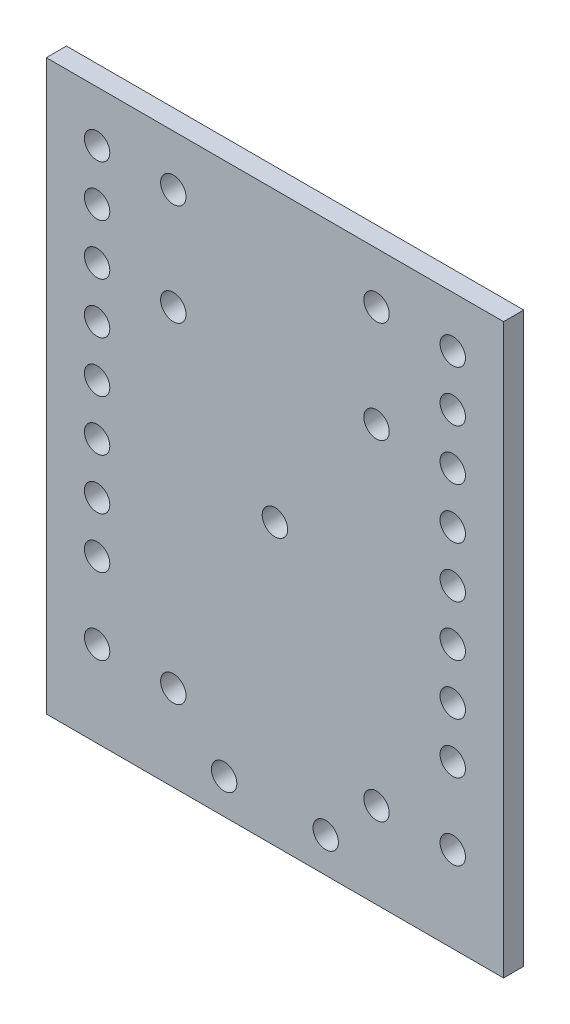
ISO-10303-21;
HEADER;
FILE_DESCRIPTION(('STEP AP214'),'2;1');
FILE_NAME('part.step','',(''),(''),'','','');
FILE_SCHEMA(('AUTOMOTIVE_DESIGN { 1 0 10303 214 1 1 1 1 }'));
ENDSEC;
DATA;
#1=APPLICATION_CONTEXT('core data for automotive mechanical design processes');
#2=APPLICATION_PROTOCOL_DEFINITION('international standard','automotive_design',2000,#1);
#3=PRODUCT_CONTEXT('',#1,'mechanical');
#4=PRODUCT('Part','Part','',(#3));
#5=PRODUCT_RELATED_PRODUCT_CATEGORY('part','',(#4));
#6=PRODUCT_DEFINITION_FORMATION('','',#4);
#7=PRODUCT_DEFINITION_CONTEXT('part definition',#1,'design');
#8=PRODUCT_DEFINITION('design','',#6,#7);
#9=PRODUCT_DEFINITION_SHAPE('','',#8);
#10=(LENGTH_UNIT() NAMED_UNIT(*) SI_UNIT(.MILLI.,.METRE.));
#11=(NAMED_UNIT(*) PLANE_ANGLE_UNIT() SI_UNIT($,.RADIAN.));
#12=(NAMED_UNIT(*) SI_UNIT($,.STERADIAN.) SOLID_ANGLE_UNIT());
#13=UNCERTAINTY_MEASURE_WITH_UNIT(LENGTH_MEASURE(1.E-05),#10,'distance_accuracy_value','');
#14=(GEOMETRIC_REPRESENTATION_CONTEXT(3) GLOBAL_UNCERTAINTY_ASSIGNED_CONTEXT((#13)) GLOBAL_UNIT_ASSIGNED_CONTEXT((#10,
#11,#12)) REPRESENTATION_CONTEXT('',''));
#15=CARTESIAN_POINT('',(0.,0.,0.));
#16=DIRECTION('',(0.,0.,1.));
#17=DIRECTION('',(1.,0.,0.));
#18=AXIS2_PLACEMENT_3D('',#15,#16,#17);
#19=CARTESIAN_POINT('',(36.,-36.,1.5875));
#20=DIRECTION('',(-1.,0.,0.));
#21=DIRECTION('',(0.,0.,1.));
#22=AXIS2_PLACEMENT_3D('',#19,#20,#21);
#23=PLANE('',#22);
#24=DIRECTION('',(0.,1.,0.));
#25=VECTOR('',#24,1.);
#26=CARTESIAN_POINT('',(36.,-36.,-1.5875));
#27=LINE('',#26,#25);
#28=CARTESIAN_POINT('',(36.,-53.5,-1.5875));
#29=VERTEX_POINT('',#28);
#30=CARTESIAN_POINT('',(36.,36.,-1.5875));
#31=VERTEX_POINT('',#30);
#32=EDGE_CURVE('E83',#29,#31,#27,.T.);
#33=ORIENTED_EDGE('',*,*,#32,.T.);
#34=DIRECTION('',(0.,0.,-1.));
#35=VECTOR('',#34,1.);
#36=CARTESIAN_POINT('',(36.,36.,1.5875));
#37=LINE('',#36,#35);
#38=CARTESIAN_POINT('',(36.,36.,1.5875));
#39=VERTEX_POINT('',#38);
#40=EDGE_CURVE('E11',#39,#31,#37,.T.);
#41=ORIENTED_EDGE('',*,*,#40,.F.);
#42=DIRECTION('',(0.,1.,0.));
#43=VECTOR('',#42,1.);
#44=CARTESIAN_POINT('',(36.,-36.,1.5875));
#45=LINE('',#44,#43);
#46=CARTESIAN_POINT('',(36.,-53.5,1.5875));
#47=VERTEX_POINT('',#46);
#48=EDGE_CURVE('E74',#47,#39,#45,.T.);
#49=ORIENTED_EDGE('',*,*,#48,.F.);
#50=DIRECTION('',(0.,0.,-1.));
#51=VECTOR('',#50,1.);
#52=CARTESIAN_POINT('',(36.,-53.5,1.5875));
#53=LINE('',#52,#51);
#54=EDGE_CURVE('E95',#47,#29,#53,.T.);
#55=ORIENTED_EDGE('',*,*,#54,.T.);
#56=EDGE_LOOP('',(#33,#41,#49,#55));
#57=FACE_BOUND('',#56,.T.);
#58=ADVANCED_FACE('F39',(#57),#23,.F.);
#59=CARTESIAN_POINT('',(-36.,36.,1.5875));
#60=DIRECTION('',(0.,-1.,0.));
#61=DIRECTION('',(0.,0.,-1.));
#62=AXIS2_PLACEMENT_3D('',#59,#60,#61);
#63=PLANE('',#62);
#64=DIRECTION('',(-1.,0.,0.));
#65=VECTOR('',#64,1.);
#66=CARTESIAN_POINT('',(-36.,36.,-1.5875));
#67=LINE('',#66,#65);
#68=CARTESIAN_POINT('',(-36.,36.,-1.5875));
#69=VERTEX_POINT('',#68);
#70=EDGE_CURVE('E67',#31,#69,#67,.T.);
#71=ORIENTED_EDGE('',*,*,#70,.T.);
#72=DIRECTION('',(0.,0.,-1.));
#73=VECTOR('',#72,1.);
#74=CARTESIAN_POINT('',(-36.,36.,1.5875));
#75=LINE('',#74,#73);
#76=CARTESIAN_POINT('',(-36.,36.,1.5875));
#77=VERTEX_POINT('',#76);
#78=EDGE_CURVE('E48',#77,#69,#75,.T.);
#79=ORIENTED_EDGE('',*,*,#78,.F.);
#80=DIRECTION('',(-1.,0.,0.));
#81=VECTOR('',#80,1.);
#82=CARTESIAN_POINT('',(-36.,36.,1.5875));
#83=LINE('',#82,#81);
#84=EDGE_CURVE('E56',#39,#77,#83,.T.);
#85=ORIENTED_EDGE('',*,*,#84,.F.);
#86=ORIENTED_EDGE('',*,*,#40,.T.);
#87=EDGE_LOOP('',(#71,#79,#85,#86));
#88=FACE_BOUND('',#87,.T.);
#89=ADVANCED_FACE('F231',(#88),#63,.F.);
#90=CARTESIAN_POINT('',(-36.,-36.,1.5875));
#91=DIRECTION('',(1.,0.,0.));
#92=DIRECTION('',(0.,0.,-1.));
#93=AXIS2_PLACEMENT_3D('',#90,#91,#92);
#94=PLANE('',#93);
#95=DIRECTION('',(0.,-1.,0.));
#96=VECTOR('',#95,1.);
#97=CARTESIAN_POINT('',(-36.,-36.,-1.5875));
#98=LINE('',#97,#96);
#99=CARTESIAN_POINT('',(-36.,-53.5,-1.5875));
#100=VERTEX_POINT('',#99);
#101=EDGE_CURVE('E215',#69,#100,#98,.T.);
#102=ORIENTED_EDGE('',*,*,#101,.T.);
#103=DIRECTION('',(0.,0.,-1.));
#104=VECTOR('',#103,1.);
#105=CARTESIAN_POINT('',(-36.,-53.5,1.5875));
#106=LINE('',#105,#104);
#107=CARTESIAN_POINT('',(-36.,-53.5,1.5875));
#108=VERTEX_POINT('',#107);
#109=EDGE_CURVE('E97',#108,#100,#106,.T.);
#110=ORIENTED_EDGE('',*,*,#109,.F.);
#111=DIRECTION('',(0.,-1.,0.));
#112=VECTOR('',#111,1.);
#113=CARTESIAN_POINT('',(-36.,-36.,1.5875));
#114=LINE('',#113,#112);
#115=EDGE_CURVE('E218',#77,#108,#114,.T.);
#116=ORIENTED_EDGE('',*,*,#115,.F.);
#117=ORIENTED_EDGE('',*,*,#78,.T.);
#118=EDGE_LOOP('',(#102,#110,#116,#117));
#119=FACE_BOUND('',#118,.T.);
#120=ADVANCED_FACE('F229',(#119),#94,.F.);
#121=CARTESIAN_POINT('',(0.,0.,1.5875));
#122=DIRECTION('',(0.,0.,-1.));
#123=DIRECTION('',(-1.,0.,0.));
#124=AXIS2_PLACEMENT_3D('',#121,#122,#123);
#125=PLANE('',#124);
#126=CARTESIAN_POINT('',(7.99999999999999,-48.,1.5875));
#127=DIRECTION('',(0.,0.,-1.));
#128=DIRECTION('',(-1.,0.,0.));
#129=AXIS2_PLACEMENT_3D('',#126,#127,#128);
#130=CIRCLE('',#129,2.);
#131=CARTESIAN_POINT('',(5.99999999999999,-48.,1.5875));
#132=VERTEX_POINT('',#131);
#133=EDGE_CURVE('E713',#132,#132,#130,.T.);
#134=ORIENTED_EDGE('',*,*,#133,.T.);
#135=EDGE_LOOP('',(#134));
#136=FACE_BOUND('',#135,.T.);
#137=CARTESIAN_POINT('',(16.,-40.,1.5875));
#138=DIRECTION('',(0.,0.,-1.));
#139=DIRECTION('',(-1.,0.,0.));
#140=AXIS2_PLACEMENT_3D('',#137,#138,#139);
#141=CIRCLE('',#140,2.);
#142=CARTESIAN_POINT('',(14.,-40.,1.5875));
#143=VERTEX_POINT('',#142);
#144=EDGE_CURVE('E723',#143,#143,#141,.T.);
#145=ORIENTED_EDGE('',*,*,#144,.T.);
#146=EDGE_LOOP('',(#145));
#147=FACE_BOUND('',#146,.T.);
#148=CARTESIAN_POINT('',(16.,28.,1.5875));
#149=DIRECTION('',(0.,0.,-1.));
#150=DIRECTION('',(-1.,0.,0.));
#151=AXIS2_PLACEMENT_3D('',#148,#149,#150);
#152=CIRCLE('',#151,2.);
#153=CARTESIAN_POINT('',(14.,28.,1.5875));
#154=VERTEX_POINT('',#153);
#155=EDGE_CURVE('E737',#154,#154,#152,.T.);
#156=ORIENTED_EDGE('',*,*,#155,.T.);
#157=EDGE_LOOP('',(#156));
#158=FACE_BOUND('',#157,.T.);
#159=CARTESIAN_POINT('',(28.,20.,1.5875));
#160=DIRECTION('',(0.,0.,-1.));
#161=DIRECTION('',(-1.,0.,0.));
#162=AXIS2_PLACEMENT_3D('',#159,#160,#161);
#163=CIRCLE('',#162,2.);
#164=CARTESIAN_POINT('',(26.,20.,1.5875));
#165=VERTEX_POINT('',#164);
#166=EDGE_CURVE('E747',#165,#165,#163,.T.);
#167=ORIENTED_EDGE('',*,*,#166,.T.);
#168=EDGE_LOOP('',(#167));
#169=FACE_BOUND('',#168,.T.);
#170=CARTESIAN_POINT('',(28.,12.,1.5875));
#171=DIRECTION('',(0.,0.,-1.));
#172=DIRECTION('',(-1.,0.,0.));
#173=AXIS2_PLACEMENT_3D('',#170,#171,#172);
#174=CIRCLE('',#173,2.);
#175=CARTESIAN_POINT('',(26.,12.,1.5875));
#176=VERTEX_POINT('',#175);
#177=EDGE_CURVE('E755',#176,#176,#174,.T.);
#178=ORIENTED_EDGE('',*,*,#177,.T.);
#179=EDGE_LOOP('',(#178));
#180=FACE_BOUND('',#179,.T.);
#181=CARTESIAN_POINT('',(28.,4.,1.5875));
#182=DIRECTION('',(0.,0.,-1.));
#183=DIRECTION('',(-1.,0.,0.));
#184=AXIS2_PLACEMENT_3D('',#181,#182,#183);
#185=CIRCLE('',#184,2.);
#186=CARTESIAN_POINT('',(26.,4.,1.5875));
#187=VERTEX_POINT('',#186);
#188=EDGE_CURVE('E763',#187,#187,#185,.T.);
#189=ORIENTED_EDGE('',*,*,#188,.T.);
#190=EDGE_LOOP('',(#189));
#191=FACE_BOUND('',#190,.T.);
#192=CARTESIAN_POINT('',(28.,-4.,1.5875));
#193=DIRECTION('',(0.,0.,-1.));
#194=DIRECTION('',(-1.,0.,0.));
#195=AXIS2_PLACEMENT_3D('',#192,#193,#194);
#196=CIRCLE('',#195,2.);
#197=CARTESIAN_POINT('',(26.,-4.,1.5875));
#198=VERTEX_POINT('',#197);
#199=EDGE_CURVE('E771',#198,#198,#196,.T.);
#200=ORIENTED_EDGE('',*,*,#199,.T.);
#201=EDGE_LOOP('',(#200));
#202=FACE_BOUND('',#201,.T.);
#203=CARTESIAN_POINT('',(28.,-12.,1.5875));
#204=DIRECTION('',(0.,0.,-1.));
#205=DIRECTION('',(-1.,0.,0.));
#206=AXIS2_PLACEMENT_3D('',#203,#204,#205);
#207=CIRCLE('',#206,2.);
#208=CARTESIAN_POINT('',(26.,-12.,1.5875));
#209=VERTEX_POINT('',#208);
#210=EDGE_CURVE('E779',#209,#209,#207,.T.);
#211=ORIENTED_EDGE('',*,*,#210,.T.);
#212=EDGE_LOOP('',(#211));
#213=FACE_BOUND('',#212,.T.);
#214=CARTESIAN_POINT('',(28.,-20.,1.5875));
#215=DIRECTION('',(0.,0.,-1.));
#216=DIRECTION('',(-1.,0.,0.));
#217=AXIS2_PLACEMENT_3D('',#214,#215,#216);
#218=CIRCLE('',#217,2.);
#219=CARTESIAN_POINT('',(26.,-20.,1.5875));
#220=VERTEX_POINT('',#219);
#221=EDGE_CURVE('E787',#220,#220,#218,.T.);
#222=ORIENTED_EDGE('',*,*,#221,.T.);
#223=EDGE_LOOP('',(#222));
#224=FACE_BOUND('',#223,.T.);
#225=CARTESIAN_POINT('',(28.,-28.,1.5875));
#226=DIRECTION('',(0.,0.,-1.));
#227=DIRECTION('',(-1.,0.,0.));
#228=AXIS2_PLACEMENT_3D('',#225,#226,#227);
#229=CIRCLE('',#228,2.);
#230=CARTESIAN_POINT('',(26.,-28.,1.5875));
#231=VERTEX_POINT('',#230);
#232=EDGE_CURVE('E736',#231,#231,#229,.T.);
#233=ORIENTED_EDGE('',*,*,#232,.T.);
#234=EDGE_LOOP('',(#233));
#235=FACE_BOUND('',#234,.T.);
#236=CARTESIAN_POINT('',(16.,12.,1.5875));
#237=DIRECTION('',(0.,0.,-1.));
#238=DIRECTION('',(-1.,0.,0.));
#239=AXIS2_PLACEMENT_3D('',#236,#237,#238);
#240=CIRCLE('',#239,2.);
#241=CARTESIAN_POINT('',(14.,12.,1.5875));
#242=VERTEX_POINT('',#241);
#243=EDGE_CURVE('E720',#242,#242,#240,.T.);
#244=ORIENTED_EDGE('',*,*,#243,.T.);
#245=EDGE_LOOP('',(#244));
#246=FACE_BOUND('',#245,.T.);
#247=CARTESIAN_POINT('',(28.,28.,1.5875));
#248=DIRECTION('',(0.,0.,-1.));
#249=DIRECTION('',(-1.,0.,0.));
#250=AXIS2_PLACEMENT_3D('',#247,#248,#249);
#251=CIRCLE('',#250,2.);
#252=CARTESIAN_POINT('',(26.,28.,1.5875));
#253=VERTEX_POINT('',#252);
#254=EDGE_CURVE('E746',#253,#253,#251,.T.);
#255=ORIENTED_EDGE('',*,*,#254,.T.);
#256=EDGE_LOOP('',(#255));
#257=FACE_BOUND('',#256,.T.);
#258=CARTESIAN_POINT('',(-7.99999999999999,-48.,1.5875));
#259=DIRECTION('',(0.,0.,1.));
#260=DIRECTION('',(1.,0.,0.));
#261=AXIS2_PLACEMENT_3D('',#258,#259,#260);
#262=CIRCLE('',#261,2.);
#263=CARTESIAN_POINT('',(-5.99999999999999,-48.,1.5875));
#264=VERTEX_POINT('',#263);
#265=EDGE_CURVE('E812',#264,#264,#262,.T.);
#266=ORIENTED_EDGE('',*,*,#265,.F.);
#267=EDGE_LOOP('',(#266));
#268=FACE_BOUND('',#267,.T.);
#269=CARTESIAN_POINT('',(-16.,-40.,1.5875));
#270=DIRECTION('',(0.,0.,1.));
#271=DIRECTION('',(1.,0.,0.));
#272=AXIS2_PLACEMENT_3D('',#269,#270,#271);
#273=CIRCLE('',#272,2.);
#274=CARTESIAN_POINT('',(-14.,-40.,1.5875));
#275=VERTEX_POINT('',#274);
#276=EDGE_CURVE('E816',#275,#275,#273,.T.);
#277=ORIENTED_EDGE('',*,*,#276,.F.);
#278=EDGE_LOOP('',(#277));
#279=FACE_BOUND('',#278,.T.);
#280=CARTESIAN_POINT('',(-28.,-40.,1.5875));
#281=DIRECTION('',(0.,0.,1.));
#282=DIRECTION('',(1.,0.,0.));
#283=AXIS2_PLACEMENT_3D('',#280,#281,#282);
#284=CIRCLE('',#283,2.);
#285=CARTESIAN_POINT('',(-26.,-40.,1.5875));
#286=VERTEX_POINT('',#285);
#287=EDGE_CURVE('E111',#286,#286,#284,.T.);
#288=ORIENTED_EDGE('',*,*,#287,.F.);
#289=EDGE_LOOP('',(#288));
#290=FACE_BOUND('',#289,.T.);
#291=CARTESIAN_POINT('',(28.,-40.,1.5875));
#292=DIRECTION('',(0.,0.,1.));
#293=DIRECTION('',(-1.,0.,0.));
#294=AXIS2_PLACEMENT_3D('',#291,#292,#293);
#295=CIRCLE('',#294,2.);
#296=CARTESIAN_POINT('',(26.,-40.,1.5875));
#297=VERTEX_POINT('',#296);
#298=EDGE_CURVE('E116',#297,#297,#295,.T.);
#299=ORIENTED_EDGE('',*,*,#298,.F.);
#300=EDGE_LOOP('',(#299));
#301=FACE_BOUND('',#300,.T.);
#302=CARTESIAN_POINT('',(0.,-9.34223898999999,1.5875));
#303=DIRECTION('',(0.,0.,1.));
#304=DIRECTION('',(1.,0.,0.));
#305=AXIS2_PLACEMENT_3D('',#302,#303,#304);
#306=CIRCLE('',#305,2.);
#307=CARTESIAN_POINT('',(2.,-9.34223898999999,1.5875));
#308=VERTEX_POINT('',#307);
#309=EDGE_CURVE('E120',#308,#308,#306,.T.);
#310=ORIENTED_EDGE('',*,*,#309,.F.);
#311=EDGE_LOOP('',(#310));
#312=FACE_BOUND('',#311,.T.);
#313=CARTESIAN_POINT('',(-16.,28.,1.5875));
#314=DIRECTION('',(0.,0.,1.));
#315=DIRECTION('',(1.,0.,0.));
#316=AXIS2_PLACEMENT_3D('',#313,#314,#315);
#317=CIRCLE('',#316,2.);
#318=CARTESIAN_POINT('',(-14.,28.,1.5875));
#319=VERTEX_POINT('',#318);
#320=EDGE_CURVE('E147',#319,#319,#317,.T.);
#321=ORIENTED_EDGE('',*,*,#320,.F.);
#322=EDGE_LOOP('',(#321));
#323=FACE_BOUND('',#322,.T.);
#324=CARTESIAN_POINT('',(-28.,20.,1.5875));
#325=DIRECTION('',(0.,0.,1.));
#326=DIRECTION('',(1.,0.,0.));
#327=AXIS2_PLACEMENT_3D('',#324,#325,#326);
#328=CIRCLE('',#327,2.);
#329=CARTESIAN_POINT('',(-26.,20.,1.5875));
#330=VERTEX_POINT('',#329);
#331=EDGE_CURVE('E148',#330,#330,#328,.T.);
#332=ORIENTED_EDGE('',*,*,#331,.F.);
#333=EDGE_LOOP('',(#332));
#334=FACE_BOUND('',#333,.T.);
#335=CARTESIAN_POINT('',(-28.,12.,1.5875));
#336=DIRECTION('',(0.,0.,1.));
#337=DIRECTION('',(1.,0.,0.));
#338=AXIS2_PLACEMENT_3D('',#335,#336,#337);
#339=CIRCLE('',#338,2.);
#340=CARTESIAN_POINT('',(-26.,12.,1.5875));
#341=VERTEX_POINT('',#340);
#342=EDGE_CURVE('E157',#341,#341,#339,.T.);
#343=ORIENTED_EDGE('',*,*,#342,.F.);
#344=EDGE_LOOP('',(#343));
#345=FACE_BOUND('',#344,.T.);
#346=CARTESIAN_POINT('',(-28.,4.,1.5875));
#347=DIRECTION('',(0.,0.,1.));
#348=DIRECTION('',(1.,0.,0.));
#349=AXIS2_PLACEMENT_3D('',#346,#347,#348);
#350=CIRCLE('',#349,2.);
#351=CARTESIAN_POINT('',(-26.,4.,1.5875));
#352=VERTEX_POINT('',#351);
#353=EDGE_CURVE('E165',#352,#352,#350,.T.);
#354=ORIENTED_EDGE('',*,*,#353,.F.);
#355=EDGE_LOOP('',(#354));
#356=FACE_BOUND('',#355,.T.);
#357=CARTESIAN_POINT('',(-28.,-4.,1.5875));
#358=DIRECTION('',(0.,0.,1.));
#359=DIRECTION('',(1.,0.,0.));
#360=AXIS2_PLACEMENT_3D('',#357,#358,#359);
#361=CIRCLE('',#360,2.);
#362=CARTESIAN_POINT('',(-26.,-4.,1.5875));
#363=VERTEX_POINT('',#362);
#364=EDGE_CURVE('E173',#363,#363,#361,.T.);
#365=ORIENTED_EDGE('',*,*,#364,.F.);
#366=EDGE_LOOP('',(#365));
#367=FACE_BOUND('',#366,.T.);
#368=CARTESIAN_POINT('',(-28.,-12.,1.5875));
#369=DIRECTION('',(0.,0.,1.));
#370=DIRECTION('',(1.,0.,0.));
#371=AXIS2_PLACEMENT_3D('',#368,#369,#370);
#372=CIRCLE('',#371,2.);
#373=CARTESIAN_POINT('',(-26.,-12.,1.5875));
#374=VERTEX_POINT('',#373);
#375=EDGE_CURVE('E181',#374,#374,#372,.T.);
#376=ORIENTED_EDGE('',*,*,#375,.F.);
#377=EDGE_LOOP('',(#376));
#378=FACE_BOUND('',#377,.T.);
#379=CARTESIAN_POINT('',(-28.,-20.,1.5875));
#380=DIRECTION('',(0.,0.,1.));
#381=DIRECTION('',(1.,0.,0.));
#382=AXIS2_PLACEMENT_3D('',#379,#380,#381);
#383=CIRCLE('',#382,2.);
#384=CARTESIAN_POINT('',(-26.,-20.,1.5875));
#385=VERTEX_POINT('',#384);
#386=EDGE_CURVE('E189',#385,#385,#383,.T.);
#387=ORIENTED_EDGE('',*,*,#386,.F.);
#388=EDGE_LOOP('',(#387));
#389=FACE_BOUND('',#388,.T.);
#390=CARTESIAN_POINT('',(-28.,-28.,1.5875));
#391=DIRECTION('',(0.,0.,1.));
#392=DIRECTION('',(1.,0.,0.));
#393=AXIS2_PLACEMENT_3D('',#390,#391,#392);
#394=CIRCLE('',#393,2.);
#395=CARTESIAN_POINT('',(-26.,-28.,1.5875));
#396=VERTEX_POINT('',#395);
#397=EDGE_CURVE('E197',#396,#396,#394,.T.);
#398=ORIENTED_EDGE('',*,*,#397,.F.);
#399=EDGE_LOOP('',(#398));
#400=FACE_BOUND('',#399,.T.);
#401=CARTESIAN_POINT('',(-16.,12.,1.5875));
#402=DIRECTION('',(0.,0.,1.));
#403=DIRECTION('',(1.,0.,0.));
#404=AXIS2_PLACEMENT_3D('',#401,#402,#403);
#405=CIRCLE('',#404,2.);
#406=CARTESIAN_POINT('',(-14.,12.,1.5875));
#407=VERTEX_POINT('',#406);
#408=EDGE_CURVE('E138',#407,#407,#405,.T.);
#409=ORIENTED_EDGE('',*,*,#408,.F.);
#410=EDGE_LOOP('',(#409));
#411=FACE_BOUND('',#410,.T.);
#412=CARTESIAN_POINT('',(-28.,28.,1.5875));
#413=DIRECTION('',(0.,0.,1.));
#414=DIRECTION('',(1.,0.,0.));
#415=AXIS2_PLACEMENT_3D('',#412,#413,#414);
#416=CIRCLE('',#415,2.);
#417=CARTESIAN_POINT('',(-26.,28.,1.5875));
#418=VERTEX_POINT('',#417);
#419=EDGE_CURVE('E152',#418,#418,#416,.T.);
#420=ORIENTED_EDGE('',*,*,#419,.F.);
#421=EDGE_LOOP('',(#420));
#422=FACE_BOUND('',#421,.T.);
#423=ORIENTED_EDGE('',*,*,#48,.T.);
#424=ORIENTED_EDGE('',*,*,#84,.T.);
#425=ORIENTED_EDGE('',*,*,#115,.T.);
#426=DIRECTION('',(1.,0.,0.));
#427=VECTOR('',#426,1.);
#428=CARTESIAN_POINT('',(-36.,-53.5,1.5875));
#429=LINE('',#428,#427);
#430=EDGE_CURVE('E99',#108,#47,#429,.T.);
#431=ORIENTED_EDGE('',*,*,#430,.T.);
#432=EDGE_LOOP('',(#423,#424,#425,#431));
#433=FACE_BOUND('',#432,.T.);
#434=ADVANCED_FACE('F232',(#136,#147,#158,#169,#180,#191,#202,#213,#224,#235,#246,#257,#268,
#279,#290,#301,#312,#323,#334,#345,#356,#367,#378,#389,#400,#411,#422,#433),#125,.F.);
#435=CARTESIAN_POINT('',(0.,0.,-1.5875));
#436=DIRECTION('',(0.,0.,-1.));
#437=DIRECTION('',(-1.,0.,0.));
#438=AXIS2_PLACEMENT_3D('',#435,#436,#437);
#439=PLANE('',#438);
#440=CARTESIAN_POINT('',(7.99999999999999,-48.,-1.5875));
#441=DIRECTION('',(0.,0.,-1.));
#442=DIRECTION('',(-1.,0.,0.));
#443=AXIS2_PLACEMENT_3D('',#440,#441,#442);
#444=CIRCLE('',#443,2.);
#445=CARTESIAN_POINT('',(5.99999999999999,-48.,-1.5875));
#446=VERTEX_POINT('',#445);
#447=EDGE_CURVE('E711',#446,#446,#444,.T.);
#448=ORIENTED_EDGE('',*,*,#447,.F.);
#449=EDGE_LOOP('',(#448));
#450=FACE_BOUND('',#449,.T.);
#451=CARTESIAN_POINT('',(16.,-40.,-1.5875));
#452=DIRECTION('',(0.,0.,-1.));
#453=DIRECTION('',(-1.,0.,0.));
#454=AXIS2_PLACEMENT_3D('',#451,#452,#453);
#455=CIRCLE('',#454,2.);
#456=CARTESIAN_POINT('',(14.,-40.,-1.5875));
#457=VERTEX_POINT('',#456);
#458=EDGE_CURVE('E715',#457,#457,#455,.T.);
#459=ORIENTED_EDGE('',*,*,#458,.F.);
#460=EDGE_LOOP('',(#459));
#461=FACE_BOUND('',#460,.T.);
#462=CARTESIAN_POINT('',(16.,28.,-1.5875));
#463=DIRECTION('',(0.,0.,-1.));
#464=DIRECTION('',(-1.,0.,0.));
#465=AXIS2_PLACEMENT_3D('',#462,#463,#464);
#466=CIRCLE('',#465,2.);
#467=CARTESIAN_POINT('',(14.,28.,-1.5875));
#468=VERTEX_POINT('',#467);
#469=EDGE_CURVE('E741',#468,#468,#466,.T.);
#470=ORIENTED_EDGE('',*,*,#469,.F.);
#471=EDGE_LOOP('',(#470));
#472=FACE_BOUND('',#471,.T.);
#473=CARTESIAN_POINT('',(28.,20.,-1.5875));
#474=DIRECTION('',(0.,0.,-1.));
#475=DIRECTION('',(-1.,0.,0.));
#476=AXIS2_PLACEMENT_3D('',#473,#474,#475);
#477=CIRCLE('',#476,2.);
#478=CARTESIAN_POINT('',(26.,20.,-1.5875));
#479=VERTEX_POINT('',#478);
#480=EDGE_CURVE('E742',#479,#479,#477,.T.);
#481=ORIENTED_EDGE('',*,*,#480,.F.);
#482=EDGE_LOOP('',(#481));
#483=FACE_BOUND('',#482,.T.);
#484=CARTESIAN_POINT('',(28.,12.,-1.5875));
#485=DIRECTION('',(0.,0.,-1.));
#486=DIRECTION('',(-1.,0.,0.));
#487=AXIS2_PLACEMENT_3D('',#484,#485,#486);
#488=CIRCLE('',#487,2.);
#489=CARTESIAN_POINT('',(26.,12.,-1.5875));
#490=VERTEX_POINT('',#489);
#491=EDGE_CURVE('E751',#490,#490,#488,.T.);
#492=ORIENTED_EDGE('',*,*,#491,.F.);
#493=EDGE_LOOP('',(#492));
#494=FACE_BOUND('',#493,.T.);
#495=CARTESIAN_POINT('',(28.,4.,-1.5875));
#496=DIRECTION('',(0.,0.,-1.));
#497=DIRECTION('',(-1.,0.,0.));
#498=AXIS2_PLACEMENT_3D('',#495,#496,#497);
#499=CIRCLE('',#498,2.);
#500=CARTESIAN_POINT('',(26.,4.,-1.5875));
#501=VERTEX_POINT('',#500);
#502=EDGE_CURVE('E759',#501,#501,#499,.T.);
#503=ORIENTED_EDGE('',*,*,#502,.F.);
#504=EDGE_LOOP('',(#503));
#505=FACE_BOUND('',#504,.T.);
#506=CARTESIAN_POINT('',(28.,-4.,-1.5875));
#507=DIRECTION('',(0.,0.,-1.));
#508=DIRECTION('',(-1.,0.,0.));
#509=AXIS2_PLACEMENT_3D('',#506,#507,#508);
#510=CIRCLE('',#509,2.);
#511=CARTESIAN_POINT('',(26.,-4.,-1.5875));
#512=VERTEX_POINT('',#511);
#513=EDGE_CURVE('E767',#512,#512,#510,.T.);
#514=ORIENTED_EDGE('',*,*,#513,.F.);
#515=EDGE_LOOP('',(#514));
#516=FACE_BOUND('',#515,.T.);
#517=CARTESIAN_POINT('',(28.,-12.,-1.5875));
#518=DIRECTION('',(0.,0.,-1.));
#519=DIRECTION('',(-1.,0.,0.));
#520=AXIS2_PLACEMENT_3D('',#517,#518,#519);
#521=CIRCLE('',#520,2.);
#522=CARTESIAN_POINT('',(26.,-12.,-1.5875));
#523=VERTEX_POINT('',#522);
#524=EDGE_CURVE('E775',#523,#523,#521,.T.);
#525=ORIENTED_EDGE('',*,*,#524,.F.);
#526=EDGE_LOOP('',(#525));
#527=FACE_BOUND('',#526,.T.);
#528=CARTESIAN_POINT('',(28.,-20.,-1.5875));
#529=DIRECTION('',(0.,0.,-1.));
#530=DIRECTION('',(-1.,0.,0.));
#531=AXIS2_PLACEMENT_3D('',#528,#529,#530);
#532=CIRCLE('',#531,2.);
#533=CARTESIAN_POINT('',(26.,-20.,-1.5875));
#534=VERTEX_POINT('',#533);
#535=EDGE_CURVE('E783',#534,#534,#532,.T.);
#536=ORIENTED_EDGE('',*,*,#535,.F.);
#537=EDGE_LOOP('',(#536));
#538=FACE_BOUND('',#537,.T.);
#539=CARTESIAN_POINT('',(28.,-28.,-1.5875));
#540=DIRECTION('',(0.,0.,-1.));
#541=DIRECTION('',(-1.,0.,0.));
#542=AXIS2_PLACEMENT_3D('',#539,#540,#541);
#543=CIRCLE('',#542,2.);
#544=CARTESIAN_POINT('',(26.,-28.,-1.5875));
#545=VERTEX_POINT('',#544);
#546=EDGE_CURVE('E791',#545,#545,#543,.T.);
#547=ORIENTED_EDGE('',*,*,#546,.F.);
#548=EDGE_LOOP('',(#547));
#549=FACE_BOUND('',#548,.T.);
#550=CARTESIAN_POINT('',(16.,12.,-1.5875));
#551=DIRECTION('',(0.,0.,-1.));
#552=DIRECTION('',(-1.,0.,0.));
#553=AXIS2_PLACEMENT_3D('',#550,#551,#552);
#554=CIRCLE('',#553,2.);
#555=CARTESIAN_POINT('',(14.,12.,-1.5875));
#556=VERTEX_POINT('',#555);
#557=EDGE_CURVE('E732',#556,#556,#554,.T.);
#558=ORIENTED_EDGE('',*,*,#557,.F.);
#559=EDGE_LOOP('',(#558));
#560=FACE_BOUND('',#559,.T.);
#561=CARTESIAN_POINT('',(28.,28.,-1.5875));
#562=DIRECTION('',(0.,0.,-1.));
#563=DIRECTION('',(-1.,0.,0.));
#564=AXIS2_PLACEMENT_3D('',#561,#562,#563);
#565=CIRCLE('',#564,2.);
#566=CARTESIAN_POINT('',(26.,28.,-1.5875));
#567=VERTEX_POINT('',#566);
#568=EDGE_CURVE('E804',#567,#567,#565,.T.);
#569=ORIENTED_EDGE('',*,*,#568,.F.);
#570=EDGE_LOOP('',(#569));
#571=FACE_BOUND('',#570,.T.);
#572=CARTESIAN_POINT('',(-7.99999999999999,-48.,-1.5875));
#573=DIRECTION('',(0.,0.,1.));
#574=DIRECTION('',(1.,0.,0.));
#575=AXIS2_PLACEMENT_3D('',#572,#573,#574);
#576=CIRCLE('',#575,2.);
#577=CARTESIAN_POINT('',(-5.99999999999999,-48.,-1.5875));
#578=VERTEX_POINT('',#577);
#579=EDGE_CURVE('E100',#578,#578,#576,.T.);
#580=ORIENTED_EDGE('',*,*,#579,.T.);
#581=EDGE_LOOP('',(#580));
#582=FACE_BOUND('',#581,.T.);
#583=CARTESIAN_POINT('',(-16.,-40.,-1.5875));
#584=DIRECTION('',(0.,0.,1.));
#585=DIRECTION('',(1.,0.,0.));
#586=AXIS2_PLACEMENT_3D('',#583,#584,#585);
#587=CIRCLE('',#586,2.);
#588=CARTESIAN_POINT('',(-14.,-40.,-1.5875));
#589=VERTEX_POINT('',#588);
#590=EDGE_CURVE('E808',#589,#589,#587,.T.);
#591=ORIENTED_EDGE('',*,*,#590,.T.);
#592=EDGE_LOOP('',(#591));
#593=FACE_BOUND('',#592,.T.);
#594=CARTESIAN_POINT('',(-28.,-40.,-1.5875));
#595=DIRECTION('',(0.,0.,1.));
#596=DIRECTION('',(1.,0.,0.));
#597=AXIS2_PLACEMENT_3D('',#594,#595,#596);
#598=CIRCLE('',#597,2.);
#599=CARTESIAN_POINT('',(-26.,-40.,-1.5875));
#600=VERTEX_POINT('',#599);
#601=EDGE_CURVE('E115',#600,#600,#598,.T.);
#602=ORIENTED_EDGE('',*,*,#601,.T.);
#603=EDGE_LOOP('',(#602));
#604=FACE_BOUND('',#603,.T.);
#605=CARTESIAN_POINT('',(28.,-40.,-1.5875));
#606=DIRECTION('',(0.,0.,1.));
#607=DIRECTION('',(-1.,0.,0.));
#608=AXIS2_PLACEMENT_3D('',#605,#606,#607);
#609=CIRCLE('',#608,2.);
#610=CARTESIAN_POINT('',(26.,-40.,-1.5875));
#611=VERTEX_POINT('',#610);
#612=EDGE_CURVE('E107',#611,#611,#609,.T.);
#613=ORIENTED_EDGE('',*,*,#612,.T.);
#614=EDGE_LOOP('',(#613));
#615=FACE_BOUND('',#614,.T.);
#616=CARTESIAN_POINT('',(0.,-9.34223898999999,-1.5875));
#617=DIRECTION('',(0.,0.,1.));
#618=DIRECTION('',(1.,0.,0.));
#619=AXIS2_PLACEMENT_3D('',#616,#617,#618);
#620=CIRCLE('',#619,2.);
#621=CARTESIAN_POINT('',(2.,-9.34223898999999,-1.5875));
#622=VERTEX_POINT('',#621);
#623=EDGE_CURVE('E130',#622,#622,#620,.T.);
#624=ORIENTED_EDGE('',*,*,#623,.T.);
#625=EDGE_LOOP('',(#624));
#626=FACE_BOUND('',#625,.T.);
#627=CARTESIAN_POINT('',(-16.,28.,-1.5875));
#628=DIRECTION('',(0.,0.,1.));
#629=DIRECTION('',(1.,0.,0.));
#630=AXIS2_PLACEMENT_3D('',#627,#628,#629);
#631=CIRCLE('',#630,2.);
#632=CARTESIAN_POINT('',(-14.,28.,-1.5875));
#633=VERTEX_POINT('',#632);
#634=EDGE_CURVE('E143',#633,#633,#631,.T.);
#635=ORIENTED_EDGE('',*,*,#634,.T.);
#636=EDGE_LOOP('',(#635));
#637=FACE_BOUND('',#636,.T.);
#638=CARTESIAN_POINT('',(-28.,20.,-1.5875));
#639=DIRECTION('',(0.,0.,1.));
#640=DIRECTION('',(1.,0.,0.));
#641=AXIS2_PLACEMENT_3D('',#638,#639,#640);
#642=CIRCLE('',#641,2.);
#643=CARTESIAN_POINT('',(-26.,20.,-1.5875));
#644=VERTEX_POINT('',#643);
#645=EDGE_CURVE('E153',#644,#644,#642,.T.);
#646=ORIENTED_EDGE('',*,*,#645,.T.);
#647=EDGE_LOOP('',(#646));
#648=FACE_BOUND('',#647,.T.);
#649=CARTESIAN_POINT('',(-28.,12.,-1.5875));
#650=DIRECTION('',(0.,0.,1.));
#651=DIRECTION('',(1.,0.,0.));
#652=AXIS2_PLACEMENT_3D('',#649,#650,#651);
#653=CIRCLE('',#652,2.);
#654=CARTESIAN_POINT('',(-26.,12.,-1.5875));
#655=VERTEX_POINT('',#654);
#656=EDGE_CURVE('E161',#655,#655,#653,.T.);
#657=ORIENTED_EDGE('',*,*,#656,.T.);
#658=EDGE_LOOP('',(#657));
#659=FACE_BOUND('',#658,.T.);
#660=CARTESIAN_POINT('',(-28.,4.,-1.5875));
#661=DIRECTION('',(0.,0.,1.));
#662=DIRECTION('',(1.,0.,0.));
#663=AXIS2_PLACEMENT_3D('',#660,#661,#662);
#664=CIRCLE('',#663,2.);
#665=CARTESIAN_POINT('',(-26.,4.,-1.5875));
#666=VERTEX_POINT('',#665);
#667=EDGE_CURVE('E169',#666,#666,#664,.T.);
#668=ORIENTED_EDGE('',*,*,#667,.T.);
#669=EDGE_LOOP('',(#668));
#670=FACE_BOUND('',#669,.T.);
#671=CARTESIAN_POINT('',(-28.,-4.,-1.5875));
#672=DIRECTION('',(0.,0.,1.));
#673=DIRECTION('',(1.,0.,0.));
#674=AXIS2_PLACEMENT_3D('',#671,#672,#673);
#675=CIRCLE('',#674,2.);
#676=CARTESIAN_POINT('',(-26.,-4.,-1.5875));
#677=VERTEX_POINT('',#676);
#678=EDGE_CURVE('E177',#677,#677,#675,.T.);
#679=ORIENTED_EDGE('',*,*,#678,.T.);
#680=EDGE_LOOP('',(#679));
#681=FACE_BOUND('',#680,.T.);
#682=CARTESIAN_POINT('',(-28.,-12.,-1.5875));
#683=DIRECTION('',(0.,0.,1.));
#684=DIRECTION('',(1.,0.,0.));
#685=AXIS2_PLACEMENT_3D('',#682,#683,#684);
#686=CIRCLE('',#685,2.);
#687=CARTESIAN_POINT('',(-26.,-12.,-1.5875));
#688=VERTEX_POINT('',#687);
#689=EDGE_CURVE('E185',#688,#688,#686,.T.);
#690=ORIENTED_EDGE('',*,*,#689,.T.);
#691=EDGE_LOOP('',(#690));
#692=FACE_BOUND('',#691,.T.);
#693=CARTESIAN_POINT('',(-28.,-20.,-1.5875));
#694=DIRECTION('',(0.,0.,1.));
#695=DIRECTION('',(1.,0.,0.));
#696=AXIS2_PLACEMENT_3D('',#693,#694,#695);
#697=CIRCLE('',#696,2.);
#698=CARTESIAN_POINT('',(-26.,-20.,-1.5875));
#699=VERTEX_POINT('',#698);
#700=EDGE_CURVE('E193',#699,#699,#697,.T.);
#701=ORIENTED_EDGE('',*,*,#700,.T.);
#702=EDGE_LOOP('',(#701));
#703=FACE_BOUND('',#702,.T.);
#704=CARTESIAN_POINT('',(-28.,-28.,-1.5875));
#705=DIRECTION('',(0.,0.,1.));
#706=DIRECTION('',(1.,0.,0.));
#707=AXIS2_PLACEMENT_3D('',#704,#705,#706);
#708=CIRCLE('',#707,2.);
#709=CARTESIAN_POINT('',(-26.,-28.,-1.5875));
#710=VERTEX_POINT('',#709);
#711=EDGE_CURVE('E142',#710,#710,#708,.T.);
#712=ORIENTED_EDGE('',*,*,#711,.T.);
#713=EDGE_LOOP('',(#712));
#714=FACE_BOUND('',#713,.T.);
#715=CARTESIAN_POINT('',(-16.,12.,-1.5875));
#716=DIRECTION('',(0.,0.,1.));
#717=DIRECTION('',(1.,0.,0.));
#718=AXIS2_PLACEMENT_3D('',#715,#716,#717);
#719=CIRCLE('',#718,2.);
#720=CARTESIAN_POINT('',(-14.,12.,-1.5875));
#721=VERTEX_POINT('',#720);
#722=EDGE_CURVE('E134',#721,#721,#719,.T.);
#723=ORIENTED_EDGE('',*,*,#722,.T.);
#724=EDGE_LOOP('',(#723));
#725=FACE_BOUND('',#724,.T.);
#726=CARTESIAN_POINT('',(-28.,28.,-1.5875));
#727=DIRECTION('',(0.,0.,1.));
#728=DIRECTION('',(1.,0.,0.));
#729=AXIS2_PLACEMENT_3D('',#726,#727,#728);
#730=CIRCLE('',#729,2.);
#731=CARTESIAN_POINT('',(-26.,28.,-1.5875));
#732=VERTEX_POINT('',#731);
#733=EDGE_CURVE('E89',#732,#732,#730,.T.);
#734=ORIENTED_EDGE('',*,*,#733,.T.);
#735=EDGE_LOOP('',(#734));
#736=FACE_BOUND('',#735,.T.);
#737=ORIENTED_EDGE('',*,*,#32,.F.);
#738=DIRECTION('',(1.,0.,0.));
#739=VECTOR('',#738,1.);
#740=CARTESIAN_POINT('',(-36.,-53.5,-1.5875));
#741=LINE('',#740,#739);
#742=EDGE_CURVE('E86',#100,#29,#741,.T.);
#743=ORIENTED_EDGE('',*,*,#742,.F.);
#744=ORIENTED_EDGE('',*,*,#101,.F.);
#745=ORIENTED_EDGE('',*,*,#70,.F.);
#746=EDGE_LOOP('',(#737,#743,#744,#745));
#747=FACE_BOUND('',#746,.T.);
#748=ADVANCED_FACE('F85',(#450,#461,#472,#483,#494,#505,#516,#527,#538,#549,#560,#571,#582,#593,
#604,#615,#626,#637,#648,#659,#670,#681,#692,#703,#714,#725,#736,#747),#439,.T.);
#749=CARTESIAN_POINT('',(-28.,28.,-1.5875));
#750=DIRECTION('',(0.,0.,1.));
#751=DIRECTION('',(1.,0.,0.));
#752=AXIS2_PLACEMENT_3D('',#749,#750,#751);
#753=CYLINDRICAL_SURFACE('',#752,2.);
#754=ORIENTED_EDGE('',*,*,#733,.F.);
#755=EDGE_LOOP('',(#754));
#756=FACE_BOUND('',#755,.T.);
#757=ORIENTED_EDGE('',*,*,#419,.T.);
#758=EDGE_LOOP('',(#757));
#759=FACE_BOUND('',#758,.T.);
#760=ADVANCED_FACE('F240',(#756,#759),#753,.F.);
#761=CARTESIAN_POINT('',(-16.,12.,-1.5875));
#762=DIRECTION('',(0.,0.,1.));
#763=DIRECTION('',(1.,0.,0.));
#764=AXIS2_PLACEMENT_3D('',#761,#762,#763);
#765=CYLINDRICAL_SURFACE('',#764,2.);
#766=ORIENTED_EDGE('',*,*,#722,.F.);
#767=EDGE_LOOP('',(#766));
#768=FACE_BOUND('',#767,.T.);
#769=ORIENTED_EDGE('',*,*,#408,.T.);
#770=EDGE_LOOP('',(#769));
#771=FACE_BOUND('',#770,.T.);
#772=ADVANCED_FACE('F563',(#768,#771),#765,.F.);
#773=CARTESIAN_POINT('',(-28.,-28.,-1.5875));
#774=DIRECTION('',(0.,0.,1.));
#775=DIRECTION('',(1.,0.,0.));
#776=AXIS2_PLACEMENT_3D('',#773,#774,#775);
#777=CYLINDRICAL_SURFACE('',#776,2.);
#778=ORIENTED_EDGE('',*,*,#711,.F.);
#779=EDGE_LOOP('',(#778));
#780=FACE_BOUND('',#779,.T.);
#781=ORIENTED_EDGE('',*,*,#397,.T.);
#782=EDGE_LOOP('',(#781));
#783=FACE_BOUND('',#782,.T.);
#784=ADVANCED_FACE('F553',(#780,#783),#777,.F.);
#785=CARTESIAN_POINT('',(-28.,-20.,-1.5875));
#786=DIRECTION('',(0.,0.,1.));
#787=DIRECTION('',(1.,0.,0.));
#788=AXIS2_PLACEMENT_3D('',#785,#786,#787);
#789=CYLINDRICAL_SURFACE('',#788,2.);
#790=ORIENTED_EDGE('',*,*,#700,.F.);
#791=EDGE_LOOP('',(#790));
#792=FACE_BOUND('',#791,.T.);
#793=ORIENTED_EDGE('',*,*,#386,.T.);
#794=EDGE_LOOP('',(#793));
#795=FACE_BOUND('',#794,.T.);
#796=ADVANCED_FACE('F543',(#792,#795),#789,.F.);
#797=CARTESIAN_POINT('',(-28.,-12.,-1.5875));
#798=DIRECTION('',(0.,0.,1.));
#799=DIRECTION('',(1.,0.,0.));
#800=AXIS2_PLACEMENT_3D('',#797,#798,#799);
#801=CYLINDRICAL_SURFACE('',#800,2.);
#802=ORIENTED_EDGE('',*,*,#689,.F.);
#803=EDGE_LOOP('',(#802));
#804=FACE_BOUND('',#803,.T.);
#805=ORIENTED_EDGE('',*,*,#375,.T.);
#806=EDGE_LOOP('',(#805));
#807=FACE_BOUND('',#806,.T.);
#808=ADVANCED_FACE('F533',(#804,#807),#801,.F.);
#809=CARTESIAN_POINT('',(-28.,-4.,-1.5875));
#810=DIRECTION('',(0.,0.,1.));
#811=DIRECTION('',(1.,0.,0.));
#812=AXIS2_PLACEMENT_3D('',#809,#810,#811);
#813=CYLINDRICAL_SURFACE('',#812,2.);
#814=ORIENTED_EDGE('',*,*,#678,.F.);
#815=EDGE_LOOP('',(#814));
#816=FACE_BOUND('',#815,.T.);
#817=ORIENTED_EDGE('',*,*,#364,.T.);
#818=EDGE_LOOP('',(#817));
#819=FACE_BOUND('',#818,.T.);
#820=ADVANCED_FACE('F523',(#816,#819),#813,.F.);
#821=CARTESIAN_POINT('',(-28.,4.,-1.5875));
#822=DIRECTION('',(0.,0.,1.));
#823=DIRECTION('',(1.,0.,0.));
#824=AXIS2_PLACEMENT_3D('',#821,#822,#823);
#825=CYLINDRICAL_SURFACE('',#824,2.);
#826=ORIENTED_EDGE('',*,*,#667,.F.);
#827=EDGE_LOOP('',(#826));
#828=FACE_BOUND('',#827,.T.);
#829=ORIENTED_EDGE('',*,*,#353,.T.);
#830=EDGE_LOOP('',(#829));
#831=FACE_BOUND('',#830,.T.);
#832=ADVANCED_FACE('F513',(#828,#831),#825,.F.);
#833=CARTESIAN_POINT('',(-28.,12.,-1.5875));
#834=DIRECTION('',(0.,0.,1.));
#835=DIRECTION('',(1.,0.,0.));
#836=AXIS2_PLACEMENT_3D('',#833,#834,#835);
#837=CYLINDRICAL_SURFACE('',#836,2.);
#838=ORIENTED_EDGE('',*,*,#656,.F.);
#839=EDGE_LOOP('',(#838));
#840=FACE_BOUND('',#839,.T.);
#841=ORIENTED_EDGE('',*,*,#342,.T.);
#842=EDGE_LOOP('',(#841));
#843=FACE_BOUND('',#842,.T.);
#844=ADVANCED_FACE('F503',(#840,#843),#837,.F.);
#845=CARTESIAN_POINT('',(-28.,20.,-1.5875));
#846=DIRECTION('',(0.,0.,1.));
#847=DIRECTION('',(1.,0.,0.));
#848=AXIS2_PLACEMENT_3D('',#845,#846,#847);
#849=CYLINDRICAL_SURFACE('',#848,2.);
#850=ORIENTED_EDGE('',*,*,#645,.F.);
#851=EDGE_LOOP('',(#850));
#852=FACE_BOUND('',#851,.T.);
#853=ORIENTED_EDGE('',*,*,#331,.T.);
#854=EDGE_LOOP('',(#853));
#855=FACE_BOUND('',#854,.T.);
#856=ADVANCED_FACE('F493',(#852,#855),#849,.F.);
#857=CARTESIAN_POINT('',(-16.,28.,-1.5875));
#858=DIRECTION('',(0.,0.,1.));
#859=DIRECTION('',(1.,0.,0.));
#860=AXIS2_PLACEMENT_3D('',#857,#858,#859);
#861=CYLINDRICAL_SURFACE('',#860,2.);
#862=ORIENTED_EDGE('',*,*,#634,.F.);
#863=EDGE_LOOP('',(#862));
#864=FACE_BOUND('',#863,.T.);
#865=ORIENTED_EDGE('',*,*,#320,.T.);
#866=EDGE_LOOP('',(#865));
#867=FACE_BOUND('',#866,.T.);
#868=ADVANCED_FACE('F482',(#864,#867),#861,.F.);
#869=CARTESIAN_POINT('',(0.,-9.34223898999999,-1.5875));
#870=DIRECTION('',(0.,0.,1.));
#871=DIRECTION('',(1.,0.,0.));
#872=AXIS2_PLACEMENT_3D('',#869,#870,#871);
#873=CYLINDRICAL_SURFACE('',#872,2.);
#874=ORIENTED_EDGE('',*,*,#623,.F.);
#875=EDGE_LOOP('',(#874));
#876=FACE_BOUND('',#875,.T.);
#877=ORIENTED_EDGE('',*,*,#309,.T.);
#878=EDGE_LOOP('',(#877));
#879=FACE_BOUND('',#878,.T.);
#880=ADVANCED_FACE('F472',(#876,#879),#873,.F.);
#881=CARTESIAN_POINT('',(28.,-40.,-1.5875));
#882=DIRECTION('',(0.,0.,1.));
#883=DIRECTION('',(1.,0.,0.));
#884=AXIS2_PLACEMENT_3D('',#881,#882,#883);
#885=CYLINDRICAL_SURFACE('',#884,2.);
#886=ORIENTED_EDGE('',*,*,#612,.F.);
#887=EDGE_LOOP('',(#886));
#888=FACE_BOUND('',#887,.T.);
#889=ORIENTED_EDGE('',*,*,#298,.T.);
#890=EDGE_LOOP('',(#889));
#891=FACE_BOUND('',#890,.T.);
#892=ADVANCED_FACE('F463',(#888,#891),#885,.F.);
#893=CARTESIAN_POINT('',(-28.,-40.,-1.5875));
#894=DIRECTION('',(0.,0.,1.));
#895=DIRECTION('',(1.,0.,0.));
#896=AXIS2_PLACEMENT_3D('',#893,#894,#895);
#897=CYLINDRICAL_SURFACE('',#896,2.);
#898=ORIENTED_EDGE('',*,*,#601,.F.);
#899=EDGE_LOOP('',(#898));
#900=FACE_BOUND('',#899,.T.);
#901=ORIENTED_EDGE('',*,*,#287,.T.);
#902=EDGE_LOOP('',(#901));
#903=FACE_BOUND('',#902,.T.);
#904=ADVANCED_FACE('F273',(#900,#903),#897,.F.);
#905=CARTESIAN_POINT('',(-36.,-53.5,1.5875));
#906=DIRECTION('',(0.,1.,0.));
#907=DIRECTION('',(0.,0.,1.));
#908=AXIS2_PLACEMENT_3D('',#905,#906,#907);
#909=PLANE('',#908);
#910=ORIENTED_EDGE('',*,*,#742,.T.);
#911=ORIENTED_EDGE('',*,*,#54,.F.);
#912=ORIENTED_EDGE('',*,*,#430,.F.);
#913=ORIENTED_EDGE('',*,*,#109,.T.);
#914=EDGE_LOOP('',(#910,#911,#912,#913));
#915=FACE_BOUND('',#914,.T.);
#916=ADVANCED_FACE('F93',(#915),#909,.F.);
#917=CARTESIAN_POINT('',(-16.,-40.,-1.5875));
#918=DIRECTION('',(0.,0.,1.));
#919=DIRECTION('',(1.,0.,0.));
#920=AXIS2_PLACEMENT_3D('',#917,#918,#919);
#921=CYLINDRICAL_SURFACE('',#920,2.);
#922=ORIENTED_EDGE('',*,*,#590,.F.);
#923=EDGE_LOOP('',(#922));
#924=FACE_BOUND('',#923,.T.);
#925=ORIENTED_EDGE('',*,*,#276,.T.);
#926=EDGE_LOOP('',(#925));
#927=FACE_BOUND('',#926,.T.);
#928=ADVANCED_FACE('F272',(#924,#927),#921,.F.);
#929=CARTESIAN_POINT('',(-7.99999999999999,-48.,-1.5875));
#930=DIRECTION('',(0.,0.,1.));
#931=DIRECTION('',(1.,0.,0.));
#932=AXIS2_PLACEMENT_3D('',#929,#930,#931);
#933=CYLINDRICAL_SURFACE('',#932,2.);
#934=ORIENTED_EDGE('',*,*,#579,.F.);
#935=EDGE_LOOP('',(#934));
#936=FACE_BOUND('',#935,.T.);
#937=ORIENTED_EDGE('',*,*,#265,.T.);
#938=EDGE_LOOP('',(#937));
#939=FACE_BOUND('',#938,.T.);
#940=ADVANCED_FACE('F285',(#936,#939),#933,.F.);
#941=CARTESIAN_POINT('',(28.,28.,-1.5875));
#942=DIRECTION('',(0.,0.,1.));
#943=DIRECTION('',(1.,0.,0.));
#944=AXIS2_PLACEMENT_3D('',#941,#942,#943);
#945=CYLINDRICAL_SURFACE('',#944,2.);
#946=ORIENTED_EDGE('',*,*,#568,.T.);
#947=EDGE_LOOP('',(#946));
#948=FACE_BOUND('',#947,.T.);
#949=ORIENTED_EDGE('',*,*,#254,.F.);
#950=EDGE_LOOP('',(#949));
#951=FACE_BOUND('',#950,.T.);
#952=ADVANCED_FACE('F295',(#948,#951),#945,.F.);
#953=CARTESIAN_POINT('',(16.,12.,-1.5875));
#954=DIRECTION('',(0.,0.,1.));
#955=DIRECTION('',(1.,0.,0.));
#956=AXIS2_PLACEMENT_3D('',#953,#954,#955);
#957=CYLINDRICAL_SURFACE('',#956,2.);
#958=ORIENTED_EDGE('',*,*,#557,.T.);
#959=EDGE_LOOP('',(#958));
#960=FACE_BOUND('',#959,.T.);
#961=ORIENTED_EDGE('',*,*,#243,.F.);
#962=EDGE_LOOP('',(#961));
#963=FACE_BOUND('',#962,.T.);
#964=ADVANCED_FACE('F318',(#960,#963),#957,.F.);
#965=CARTESIAN_POINT('',(28.,-28.,-1.5875));
#966=DIRECTION('',(0.,0.,1.));
#967=DIRECTION('',(1.,0.,0.));
#968=AXIS2_PLACEMENT_3D('',#965,#966,#967);
#969=CYLINDRICAL_SURFACE('',#968,2.);
#970=ORIENTED_EDGE('',*,*,#546,.T.);
#971=EDGE_LOOP('',(#970));
#972=FACE_BOUND('',#971,.T.);
#973=ORIENTED_EDGE('',*,*,#232,.F.);
#974=EDGE_LOOP('',(#973));
#975=FACE_BOUND('',#974,.T.);
#976=ADVANCED_FACE('F329',(#972,#975),#969,.F.);
#977=CARTESIAN_POINT('',(28.,-20.,-1.5875));
#978=DIRECTION('',(0.,0.,1.));
#979=DIRECTION('',(1.,0.,0.));
#980=AXIS2_PLACEMENT_3D('',#977,#978,#979);
#981=CYLINDRICAL_SURFACE('',#980,2.);
#982=ORIENTED_EDGE('',*,*,#535,.T.);
#983=EDGE_LOOP('',(#982));
#984=FACE_BOUND('',#983,.T.);
#985=ORIENTED_EDGE('',*,*,#221,.F.);
#986=EDGE_LOOP('',(#985));
#987=FACE_BOUND('',#986,.T.);
#988=ADVANCED_FACE('F340',(#984,#987),#981,.F.);
#989=CARTESIAN_POINT('',(28.,-12.,-1.5875));
#990=DIRECTION('',(0.,0.,1.));
#991=DIRECTION('',(1.,0.,0.));
#992=AXIS2_PLACEMENT_3D('',#989,#990,#991);
#993=CYLINDRICAL_SURFACE('',#992,2.);
#994=ORIENTED_EDGE('',*,*,#524,.T.);
#995=EDGE_LOOP('',(#994));
#996=FACE_BOUND('',#995,.T.);
#997=ORIENTED_EDGE('',*,*,#210,.F.);
#998=EDGE_LOOP('',(#997));
#999=FACE_BOUND('',#998,.T.);
#1000=ADVANCED_FACE('F351',(#996,#999),#993,.F.);
#1001=CARTESIAN_POINT('',(28.,-4.,-1.5875));
#1002=DIRECTION('',(0.,0.,1.));
#1003=DIRECTION('',(1.,0.,0.));
#1004=AXIS2_PLACEMENT_3D('',#1001,#1002,#1003);
#1005=CYLINDRICAL_SURFACE('',#1004,2.);
#1006=ORIENTED_EDGE('',*,*,#513,.T.);
#1007=EDGE_LOOP('',(#1006));
#1008=FACE_BOUND('',#1007,.T.);
#1009=ORIENTED_EDGE('',*,*,#199,.F.);
#1010=EDGE_LOOP('',(#1009));
#1011=FACE_BOUND('',#1010,.T.);
#1012=ADVANCED_FACE('F362',(#1008,#1011),#1005,.F.);
#1013=CARTESIAN_POINT('',(28.,4.,-1.5875));
#1014=DIRECTION('',(0.,0.,1.));
#1015=DIRECTION('',(1.,0.,0.));
#1016=AXIS2_PLACEMENT_3D('',#1013,#1014,#1015);
#1017=CYLINDRICAL_SURFACE('',#1016,2.);
#1018=ORIENTED_EDGE('',*,*,#502,.T.);
#1019=EDGE_LOOP('',(#1018));
#1020=FACE_BOUND('',#1019,.T.);
#1021=ORIENTED_EDGE('',*,*,#188,.F.);
#1022=EDGE_LOOP('',(#1021));
#1023=FACE_BOUND('',#1022,.T.);
#1024=ADVANCED_FACE('F373',(#1020,#1023),#1017,.F.);
#1025=CARTESIAN_POINT('',(28.,12.,-1.5875));
#1026=DIRECTION('',(0.,0.,1.));
#1027=DIRECTION('',(1.,0.,0.));
#1028=AXIS2_PLACEMENT_3D('',#1025,#1026,#1027);
#1029=CYLINDRICAL_SURFACE('',#1028,2.);
#1030=ORIENTED_EDGE('',*,*,#491,.T.);
#1031=EDGE_LOOP('',(#1030));
#1032=FACE_BOUND('',#1031,.T.);
#1033=ORIENTED_EDGE('',*,*,#177,.F.);
#1034=EDGE_LOOP('',(#1033));
#1035=FACE_BOUND('',#1034,.T.);
#1036=ADVANCED_FACE('F384',(#1032,#1035),#1029,.F.);
#1037=CARTESIAN_POINT('',(28.,20.,-1.5875));
#1038=DIRECTION('',(0.,0.,1.));
#1039=DIRECTION('',(1.,0.,0.));
#1040=AXIS2_PLACEMENT_3D('',#1037,#1038,#1039);
#1041=CYLINDRICAL_SURFACE('',#1040,2.);
#1042=ORIENTED_EDGE('',*,*,#480,.T.);
#1043=EDGE_LOOP('',(#1042));
#1044=FACE_BOUND('',#1043,.T.);
#1045=ORIENTED_EDGE('',*,*,#166,.F.);
#1046=EDGE_LOOP('',(#1045));
#1047=FACE_BOUND('',#1046,.T.);
#1048=ADVANCED_FACE('F395',(#1044,#1047),#1041,.F.);
#1049=CARTESIAN_POINT('',(16.,28.,-1.5875));
#1050=DIRECTION('',(0.,0.,1.));
#1051=DIRECTION('',(1.,0.,0.));
#1052=AXIS2_PLACEMENT_3D('',#1049,#1050,#1051);
#1053=CYLINDRICAL_SURFACE('',#1052,2.);
#1054=ORIENTED_EDGE('',*,*,#469,.T.);
#1055=EDGE_LOOP('',(#1054));
#1056=FACE_BOUND('',#1055,.T.);
#1057=ORIENTED_EDGE('',*,*,#155,.F.);
#1058=EDGE_LOOP('',(#1057));
#1059=FACE_BOUND('',#1058,.T.);
#1060=ADVANCED_FACE('F406',(#1056,#1059),#1053,.F.);
#1061=CARTESIAN_POINT('',(16.,-40.,-1.5875));
#1062=DIRECTION('',(0.,0.,1.));
#1063=DIRECTION('',(1.,0.,0.));
#1064=AXIS2_PLACEMENT_3D('',#1061,#1062,#1063);
#1065=CYLINDRICAL_SURFACE('',#1064,2.);
#1066=ORIENTED_EDGE('',*,*,#458,.T.);
#1067=EDGE_LOOP('',(#1066));
#1068=FACE_BOUND('',#1067,.T.);
#1069=ORIENTED_EDGE('',*,*,#144,.F.);
#1070=EDGE_LOOP('',(#1069));
#1071=FACE_BOUND('',#1070,.T.);
#1072=ADVANCED_FACE('F417',(#1068,#1071),#1065,.F.);
#1073=CARTESIAN_POINT('',(7.99999999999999,-48.,-1.5875));
#1074=DIRECTION('',(0.,0.,1.));
#1075=DIRECTION('',(1.,0.,0.));
#1076=AXIS2_PLACEMENT_3D('',#1073,#1074,#1075);
#1077=CYLINDRICAL_SURFACE('',#1076,2.);
#1078=ORIENTED_EDGE('',*,*,#447,.T.);
#1079=EDGE_LOOP('',(#1078));
#1080=FACE_BOUND('',#1079,.T.);
#1081=ORIENTED_EDGE('',*,*,#133,.F.);
#1082=EDGE_LOOP('',(#1081));
#1083=FACE_BOUND('',#1082,.T.);
#1084=ADVANCED_FACE('F428',(#1080,#1083),#1077,.F.);
#1085=CLOSED_SHELL('',(#58,#89,#120,#434,#748,#760,#772,#784,#796,#808,#820,#832,#844,#856,#868,
#880,#892,#904,#916,#928,#940,#952,#964,#976,#988,#1000,#1012,#1024,#1036,#1048,#1060,#1072,#1084));
#1086=MANIFOLD_SOLID_BREP('B2',#1085);
#1087=ADVANCED_BREP_SHAPE_REPRESENTATION('',(#18,#1086),#14);
#1088=SHAPE_DEFINITION_REPRESENTATION(#9,#1087);
ENDSEC;
END-ISO-10303-21;
